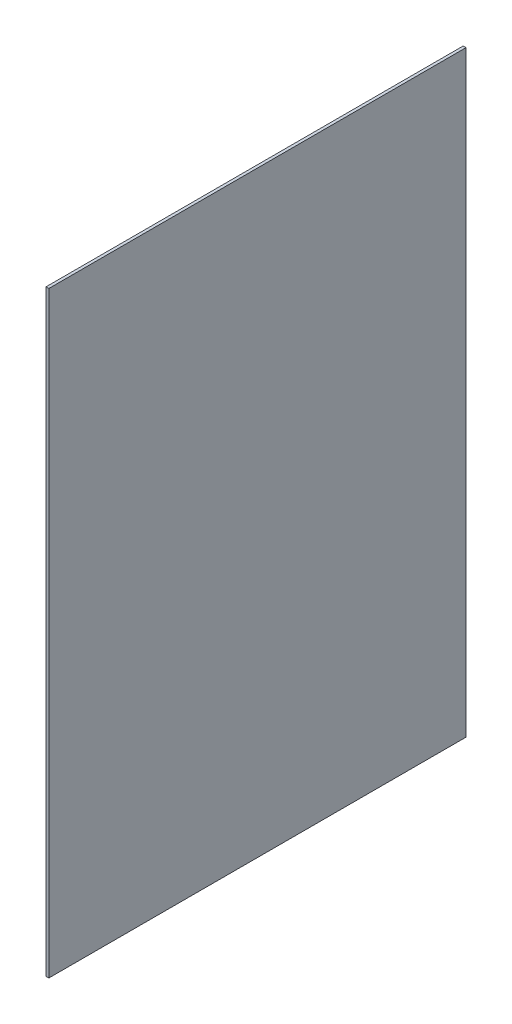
ISO-10303-21;
HEADER;
FILE_DESCRIPTION(('STEP AP214'),'2;1');
FILE_NAME('part.step','',(''),(''),'','','');
FILE_SCHEMA(('AUTOMOTIVE_DESIGN { 1 0 10303 214 1 1 1 1 }'));
ENDSEC;
DATA;
#1=APPLICATION_CONTEXT('core data for automotive mechanical design processes');
#2=APPLICATION_PROTOCOL_DEFINITION('international standard','automotive_design',2000,#1);
#3=PRODUCT_CONTEXT('',#1,'mechanical');
#4=PRODUCT('Part','Part','',(#3));
#5=PRODUCT_RELATED_PRODUCT_CATEGORY('part','',(#4));
#6=PRODUCT_DEFINITION_FORMATION('','',#4);
#7=PRODUCT_DEFINITION_CONTEXT('part definition',#1,'design');
#8=PRODUCT_DEFINITION('design','',#6,#7);
#9=PRODUCT_DEFINITION_SHAPE('','',#8);
#10=(LENGTH_UNIT() NAMED_UNIT(*) SI_UNIT(.MILLI.,.METRE.));
#11=(NAMED_UNIT(*) PLANE_ANGLE_UNIT() SI_UNIT($,.RADIAN.));
#12=(NAMED_UNIT(*) SI_UNIT($,.STERADIAN.) SOLID_ANGLE_UNIT());
#13=UNCERTAINTY_MEASURE_WITH_UNIT(LENGTH_MEASURE(1.E-05),#10,'distance_accuracy_value','');
#14=(GEOMETRIC_REPRESENTATION_CONTEXT(3) GLOBAL_UNCERTAINTY_ASSIGNED_CONTEXT((#13)) GLOBAL_UNIT_ASSIGNED_CONTEXT((#10,
#11,#12)) REPRESENTATION_CONTEXT('',''));
#15=CARTESIAN_POINT('',(0.,0.,0.));
#16=DIRECTION('',(0.,0.,1.));
#17=DIRECTION('',(1.,0.,0.));
#18=AXIS2_PLACEMENT_3D('',#15,#16,#17);
#19=CARTESIAN_POINT('',(3.,0.,0.));
#20=DIRECTION('',(0.,0.,-1.));
#21=DIRECTION('',(-1.,0.,0.));
#22=AXIS2_PLACEMENT_3D('',#19,#20,#21);
#23=PLANE('',#22);
#24=DIRECTION('',(0.,-1.,0.));
#25=VECTOR('',#24,1.);
#26=CARTESIAN_POINT('',(0.,0.,0.));
#27=LINE('',#26,#25);
#28=CARTESIAN_POINT('',(0.,630.,0.));
#29=VERTEX_POINT('',#28);
#30=CARTESIAN_POINT('',(0.,0.,0.));
#31=VERTEX_POINT('',#30);
#32=EDGE_CURVE('E113',#29,#31,#27,.T.);
#33=ORIENTED_EDGE('',*,*,#32,.T.);
#34=DIRECTION('',(-1.,0.,0.));
#35=VECTOR('',#34,1.);
#36=CARTESIAN_POINT('',(3.,0.,0.));
#37=LINE('',#36,#35);
#38=CARTESIAN_POINT('',(3.,0.,0.));
#39=VERTEX_POINT('',#38);
#40=EDGE_CURVE('E11',#39,#31,#37,.T.);
#41=ORIENTED_EDGE('',*,*,#40,.F.);
#42=DIRECTION('',(0.,-1.,0.));
#43=VECTOR('',#42,1.);
#44=CARTESIAN_POINT('',(3.,0.,0.));
#45=LINE('',#44,#43);
#46=CARTESIAN_POINT('',(3.,630.,0.));
#47=VERTEX_POINT('',#46);
#48=EDGE_CURVE('E97',#47,#39,#45,.T.);
#49=ORIENTED_EDGE('',*,*,#48,.F.);
#50=DIRECTION('',(-1.,0.,0.));
#51=VECTOR('',#50,1.);
#52=CARTESIAN_POINT('',(3.,630.,0.));
#53=LINE('',#52,#51);
#54=EDGE_CURVE('E109',#47,#29,#53,.T.);
#55=ORIENTED_EDGE('',*,*,#54,.T.);
#56=EDGE_LOOP('',(#33,#41,#49,#55));
#57=FACE_BOUND('',#56,.T.);
#58=ADVANCED_FACE('F45',(#57),#23,.F.);
#59=CARTESIAN_POINT('',(3.,0.,0.));
#60=DIRECTION('',(0.,1.,0.));
#61=DIRECTION('',(0.,0.,1.));
#62=AXIS2_PLACEMENT_3D('',#59,#60,#61);
#63=PLANE('',#62);
#64=DIRECTION('',(0.,0.,-1.));
#65=VECTOR('',#64,1.);
#66=CARTESIAN_POINT('',(0.,0.,0.));
#67=LINE('',#66,#65);
#68=CARTESIAN_POINT('',(0.,0.,-440.));
#69=VERTEX_POINT('',#68);
#70=EDGE_CURVE('E102',#31,#69,#67,.T.);
#71=ORIENTED_EDGE('',*,*,#70,.T.);
#72=DIRECTION('',(-1.,0.,0.));
#73=VECTOR('',#72,1.);
#74=CARTESIAN_POINT('',(3.,0.,-440.));
#75=LINE('',#74,#73);
#76=CARTESIAN_POINT('',(3.,0.,-440.));
#77=VERTEX_POINT('',#76);
#78=EDGE_CURVE('E54',#77,#69,#75,.T.);
#79=ORIENTED_EDGE('',*,*,#78,.F.);
#80=DIRECTION('',(0.,0.,-1.));
#81=VECTOR('',#80,1.);
#82=CARTESIAN_POINT('',(3.,0.,0.));
#83=LINE('',#82,#81);
#84=EDGE_CURVE('E92',#39,#77,#83,.T.);
#85=ORIENTED_EDGE('',*,*,#84,.F.);
#86=ORIENTED_EDGE('',*,*,#40,.T.);
#87=EDGE_LOOP('',(#71,#79,#85,#86));
#88=FACE_BOUND('',#87,.T.);
#89=ADVANCED_FACE('F101',(#88),#63,.F.);
#90=CARTESIAN_POINT('',(3.,0.,-440.));
#91=DIRECTION('',(0.,0.,1.));
#92=DIRECTION('',(1.,0.,0.));
#93=AXIS2_PLACEMENT_3D('',#90,#91,#92);
#94=PLANE('',#93);
#95=DIRECTION('',(0.,1.,0.));
#96=VECTOR('',#95,1.);
#97=CARTESIAN_POINT('',(0.,0.,-440.));
#98=LINE('',#97,#96);
#99=CARTESIAN_POINT('',(0.,630.,-440.));
#100=VERTEX_POINT('',#99);
#101=EDGE_CURVE('E79',#69,#100,#98,.T.);
#102=ORIENTED_EDGE('',*,*,#101,.T.);
#103=DIRECTION('',(-1.,0.,0.));
#104=VECTOR('',#103,1.);
#105=CARTESIAN_POINT('',(3.,630.,-440.));
#106=LINE('',#105,#104);
#107=CARTESIAN_POINT('',(3.,630.,-440.));
#108=VERTEX_POINT('',#107);
#109=EDGE_CURVE('E104',#108,#100,#106,.T.);
#110=ORIENTED_EDGE('',*,*,#109,.F.);
#111=DIRECTION('',(0.,1.,0.));
#112=VECTOR('',#111,1.);
#113=CARTESIAN_POINT('',(3.,0.,-440.));
#114=LINE('',#113,#112);
#115=EDGE_CURVE('E95',#77,#108,#114,.T.);
#116=ORIENTED_EDGE('',*,*,#115,.F.);
#117=ORIENTED_EDGE('',*,*,#78,.T.);
#118=EDGE_LOOP('',(#102,#110,#116,#117));
#119=FACE_BOUND('',#118,.T.);
#120=ADVANCED_FACE('F105',(#119),#94,.F.);
#121=CARTESIAN_POINT('',(3.,630.,0.));
#122=DIRECTION('',(0.,-1.,0.));
#123=DIRECTION('',(0.,0.,-1.));
#124=AXIS2_PLACEMENT_3D('',#121,#122,#123);
#125=PLANE('',#124);
#126=DIRECTION('',(0.,0.,1.));
#127=VECTOR('',#126,1.);
#128=CARTESIAN_POINT('',(0.,630.,0.));
#129=LINE('',#128,#127);
#130=EDGE_CURVE('E85',#100,#29,#129,.T.);
#131=ORIENTED_EDGE('',*,*,#130,.T.);
#132=ORIENTED_EDGE('',*,*,#54,.F.);
#133=DIRECTION('',(0.,0.,1.));
#134=VECTOR('',#133,1.);
#135=CARTESIAN_POINT('',(3.,630.,0.));
#136=LINE('',#135,#134);
#137=EDGE_CURVE('E62',#108,#47,#136,.T.);
#138=ORIENTED_EDGE('',*,*,#137,.F.);
#139=ORIENTED_EDGE('',*,*,#109,.T.);
#140=EDGE_LOOP('',(#131,#132,#138,#139));
#141=FACE_BOUND('',#140,.T.);
#142=ADVANCED_FACE('F126',(#141),#125,.F.);
#143=CARTESIAN_POINT('',(3.,0.,0.));
#144=DIRECTION('',(-1.,0.,0.));
#145=DIRECTION('',(0.,0.,1.));
#146=AXIS2_PLACEMENT_3D('',#143,#144,#145);
#147=PLANE('',#146);
#148=ORIENTED_EDGE('',*,*,#48,.T.);
#149=ORIENTED_EDGE('',*,*,#84,.T.);
#150=ORIENTED_EDGE('',*,*,#115,.T.);
#151=ORIENTED_EDGE('',*,*,#137,.T.);
#152=EDGE_LOOP('',(#148,#149,#150,#151));
#153=FACE_BOUND('',#152,.T.);
#154=ADVANCED_FACE('F93',(#153),#147,.F.);
#155=CARTESIAN_POINT('',(0.,0.,0.));
#156=DIRECTION('',(-1.,0.,0.));
#157=DIRECTION('',(0.,0.,1.));
#158=AXIS2_PLACEMENT_3D('',#155,#156,#157);
#159=PLANE('',#158);
#160=ORIENTED_EDGE('',*,*,#32,.F.);
#161=ORIENTED_EDGE('',*,*,#130,.F.);
#162=ORIENTED_EDGE('',*,*,#101,.F.);
#163=ORIENTED_EDGE('',*,*,#70,.F.);
#164=EDGE_LOOP('',(#160,#161,#162,#163));
#165=FACE_BOUND('',#164,.T.);
#166=ADVANCED_FACE('F129',(#165),#159,.T.);
#167=CLOSED_SHELL('',(#58,#89,#120,#142,#154,#166));
#168=MANIFOLD_SOLID_BREP('B2',#167);
#169=ADVANCED_BREP_SHAPE_REPRESENTATION('',(#18,#168),#14);
#170=SHAPE_DEFINITION_REPRESENTATION(#9,#169);
ENDSEC;
END-ISO-10303-21;
